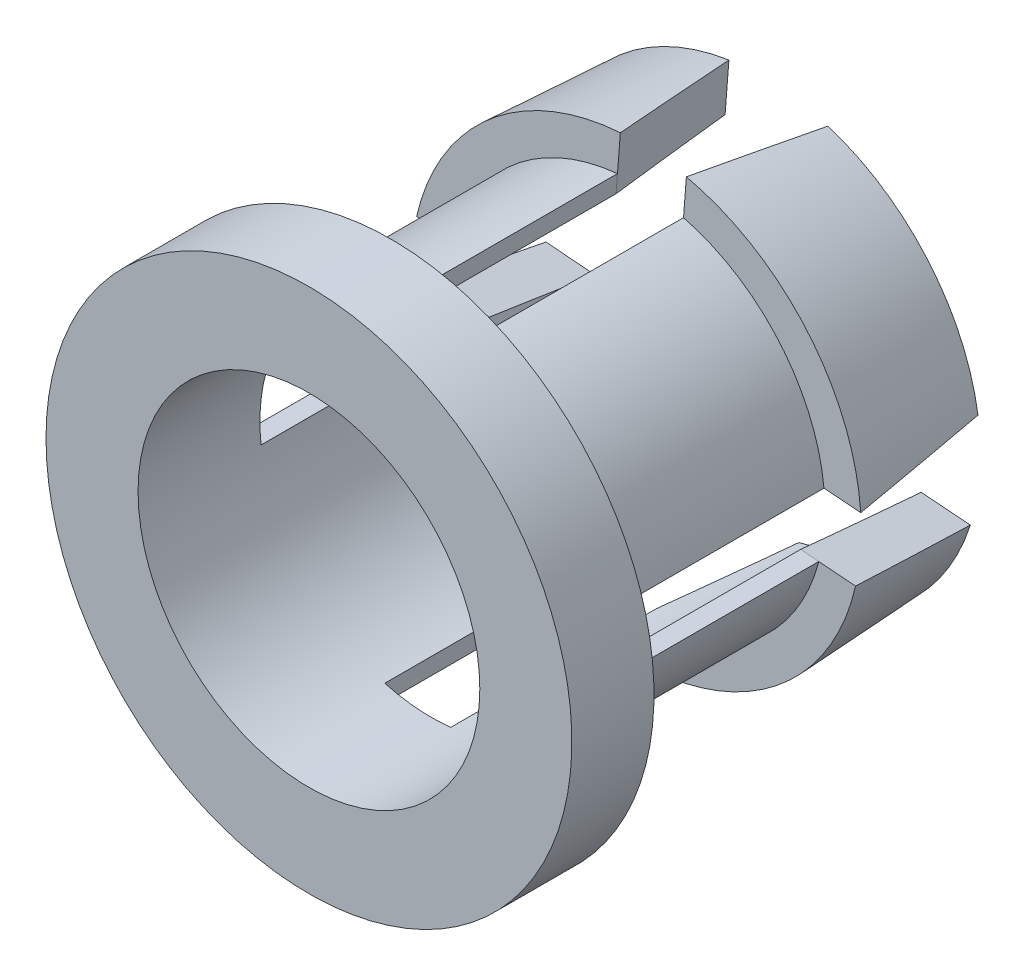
ISO-10303-21;
HEADER;
FILE_DESCRIPTION(('STEP AP214'),'2;1');
FILE_NAME('part.step','',(''),(''),'','','');
FILE_SCHEMA(('AUTOMOTIVE_DESIGN { 1 0 10303 214 1 1 1 1 }'));
ENDSEC;
DATA;
#1=APPLICATION_CONTEXT('core data for automotive mechanical design processes');
#2=APPLICATION_PROTOCOL_DEFINITION('international standard','automotive_design',2000,#1);
#3=PRODUCT_CONTEXT('',#1,'mechanical');
#4=PRODUCT('Part','Part','',(#3));
#5=PRODUCT_RELATED_PRODUCT_CATEGORY('part','',(#4));
#6=PRODUCT_DEFINITION_FORMATION('','',#4);
#7=PRODUCT_DEFINITION_CONTEXT('part definition',#1,'design');
#8=PRODUCT_DEFINITION('design','',#6,#7);
#9=PRODUCT_DEFINITION_SHAPE('','',#8);
#10=(LENGTH_UNIT() NAMED_UNIT(*) SI_UNIT(.MILLI.,.METRE.));
#11=(NAMED_UNIT(*) PLANE_ANGLE_UNIT() SI_UNIT($,.RADIAN.));
#12=(NAMED_UNIT(*) SI_UNIT($,.STERADIAN.) SOLID_ANGLE_UNIT());
#13=UNCERTAINTY_MEASURE_WITH_UNIT(LENGTH_MEASURE(1.E-05),#10,'distance_accuracy_value','');
#14=(GEOMETRIC_REPRESENTATION_CONTEXT(3) GLOBAL_UNCERTAINTY_ASSIGNED_CONTEXT((#13)) GLOBAL_UNIT_ASSIGNED_CONTEXT((#10,
#11,#12)) REPRESENTATION_CONTEXT('',''));
#15=CARTESIAN_POINT('',(0.,0.,0.));
#16=DIRECTION('',(0.,0.,1.));
#17=DIRECTION('',(1.,0.,0.));
#18=AXIS2_PLACEMENT_3D('',#15,#16,#17);
#19=CARTESIAN_POINT('',(4.30503773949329,-0.334326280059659,-4.318));
#20=DIRECTION('',(0.,0.,-1.));
#21=DIRECTION('',(-1.,0.,0.));
#22=AXIS2_PLACEMENT_3D('',#19,#20,#21);
#23=PLANE('',#22);
#24=DIRECTION('',(-0.996998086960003,0.0774261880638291,0.));
#25=VECTOR('',#24,1.);
#26=CARTESIAN_POINT('',(-3.50350037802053,0.908991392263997,-4.318));
#27=LINE('',#26,#25);
#28=CARTESIAN_POINT('',(-3.50350037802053,0.908991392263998,-4.318));
#29=VERTEX_POINT('',#28);
#30=CARTESIAN_POINT('',(-4.20906665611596,0.963785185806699,-4.31800000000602));
#31=VERTEX_POINT('',#30);
#32=EDGE_CURVE('E197',#29,#31,#27,.T.);
#33=ORIENTED_EDGE('',*,*,#32,.F.);
#34=CARTESIAN_POINT('',(0.,0.,-4.318));
#35=DIRECTION('',(0.,0.,-1.));
#36=DIRECTION('',(-1.,0.,0.));
#37=AXIS2_PLACEMENT_3D('',#34,#35,#36);
#38=CIRCLE('',#37,3.6195);
#39=CARTESIAN_POINT('',(-0.35719617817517,3.60183163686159,-4.318));
#40=VERTEX_POINT('',#39);
#41=EDGE_CURVE('E556',#40,#29,#38,.F.);
#42=ORIENTED_EDGE('',*,*,#41,.F.);
#43=DIRECTION('',(-0.077426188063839,-0.996998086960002,0.));
#44=VECTOR('',#43,1.);
#45=CARTESIAN_POINT('',(-0.302402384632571,4.30739791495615,-4.318));
#46=LINE('',#45,#44);
#47=CARTESIAN_POINT('',(-0.302402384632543,4.30739791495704,-4.31800000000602));
#48=VERTEX_POINT('',#47);
#49=EDGE_CURVE('E209',#48,#40,#46,.T.);
#50=ORIENTED_EDGE('',*,*,#49,.F.);
#51=CARTESIAN_POINT('',(0.,0.,-4.31800000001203));
#52=DIRECTION('',(0.,0.,1.));
#53=DIRECTION('',(1.,0.,0.));
#54=AXIS2_PLACEMENT_3D('',#51,#52,#53);
#55=CIRCLE('',#54,4.31800000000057);
#56=EDGE_CURVE('E20',#31,#48,#55,.F.);
#57=ORIENTED_EDGE('',*,*,#56,.F.);
#58=EDGE_LOOP('',(#33,#42,#50,#57));
#59=FACE_BOUND('',#58,.T.);
#60=ADVANCED_FACE('F17',(#59),#23,.F.);
#61=CARTESIAN_POINT('',(4.30503773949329,-0.334326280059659,-4.318));
#62=DIRECTION('',(0.,0.,-1.));
#63=DIRECTION('',(-1.,0.,0.));
#64=AXIS2_PLACEMENT_3D('',#61,#62,#63);
#65=PLANE('',#64);
#66=DIRECTION('',(0.996998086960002,-0.0774261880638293,0.));
#67=VECTOR('',#66,1.);
#68=CARTESIAN_POINT('',(-4.30739791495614,-0.302402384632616,-4.318));
#69=LINE('',#68,#67);
#70=CARTESIAN_POINT('',(-4.30739791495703,-0.302402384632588,-4.31800000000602));
#71=VERTEX_POINT('',#70);
#72=CARTESIAN_POINT('',(-3.60183163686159,-0.357196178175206,-4.318));
#73=VERTEX_POINT('',#72);
#74=EDGE_CURVE('E559',#71,#73,#69,.T.);
#75=ORIENTED_EDGE('',*,*,#74,.F.);
#76=CARTESIAN_POINT('',(0.,0.,-4.31800000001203));
#77=DIRECTION('',(0.,0.,1.));
#78=DIRECTION('',(1.,0.,0.));
#79=AXIS2_PLACEMENT_3D('',#76,#77,#78);
#80=CIRCLE('',#79,4.31800000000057);
#81=CARTESIAN_POINT('',(-0.963785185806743,-4.20906665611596,-4.31800000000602));
#82=VERTEX_POINT('',#81);
#83=EDGE_CURVE('E215',#82,#71,#80,.F.);
#84=ORIENTED_EDGE('',*,*,#83,.F.);
#85=DIRECTION('',(-0.0774261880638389,-0.996998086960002,0.));
#86=VECTOR('',#85,1.);
#87=CARTESIAN_POINT('',(-0.908991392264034,-3.50350037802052,-4.318));
#88=LINE('',#87,#86);
#89=CARTESIAN_POINT('',(-0.908991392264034,-3.50350037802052,-4.318));
#90=VERTEX_POINT('',#89);
#91=EDGE_CURVE('E208',#90,#82,#88,.T.);
#92=ORIENTED_EDGE('',*,*,#91,.F.);
#93=CARTESIAN_POINT('',(0.,0.,-4.318));
#94=DIRECTION('',(0.,0.,-1.));
#95=DIRECTION('',(-1.,0.,0.));
#96=AXIS2_PLACEMENT_3D('',#93,#94,#95);
#97=CIRCLE('',#96,3.6195);
#98=EDGE_CURVE('E554',#73,#90,#97,.F.);
#99=ORIENTED_EDGE('',*,*,#98,.F.);
#100=EDGE_LOOP('',(#75,#84,#92,#99));
#101=FACE_BOUND('',#100,.T.);
#102=ADVANCED_FACE('F256',(#101),#65,.F.);
#103=CARTESIAN_POINT('',(3.60863457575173,-0.280244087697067,0.381));
#104=DIRECTION('',(0.,0.,1.));
#105=DIRECTION('',(1.,0.,0.));
#106=AXIS2_PLACEMENT_3D('',#103,#104,#105);
#107=PLANE('',#106);
#108=CARTESIAN_POINT('',(0.,0.,0.381));
#109=DIRECTION('',(0.,0.,-1.));
#110=DIRECTION('',(-1.,0.,0.));
#111=AXIS2_PLACEMENT_3D('',#108,#109,#110);
#112=CIRCLE('',#111,3.6195);
#113=CARTESIAN_POINT('',(-3.6195,0.,0.381));
#114=VERTEX_POINT('',#113);
#115=EDGE_CURVE('E540',#114,#114,#112,.T.);
#116=ORIENTED_EDGE('',*,*,#115,.F.);
#117=EDGE_LOOP('',(#116));
#118=FACE_BOUND('',#117,.T.);
#119=CARTESIAN_POINT('',(0.,0.,0.381));
#120=DIRECTION('',(0.,0.,-1.));
#121=DIRECTION('',(-1.,0.,0.));
#122=AXIS2_PLACEMENT_3D('',#119,#120,#121);
#123=CIRCLE('',#122,5.0419);
#124=CARTESIAN_POINT('',(-5.0419,0.,0.381));
#125=VERTEX_POINT('',#124);
#126=EDGE_CURVE('E551',#125,#125,#123,.F.);
#127=ORIENTED_EDGE('',*,*,#126,.F.);
#128=EDGE_LOOP('',(#127));
#129=FACE_BOUND('',#128,.T.);
#130=ADVANCED_FACE('F253',(#118,#129),#107,.F.);
#131=CARTESIAN_POINT('',(4.30503773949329,-0.334326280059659,-4.318));
#132=DIRECTION('',(0.,0.,-1.));
#133=DIRECTION('',(-1.,0.,0.));
#134=AXIS2_PLACEMENT_3D('',#131,#132,#133);
#135=PLANE('',#134);
#136=DIRECTION('',(0.996998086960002,-0.077426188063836,0.));
#137=VECTOR('',#136,1.);
#138=CARTESIAN_POINT('',(3.50350037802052,-0.908991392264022,-4.318));
#139=LINE('',#138,#137);
#140=CARTESIAN_POINT('',(3.50350037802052,-0.908991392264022,-4.318));
#141=VERTEX_POINT('',#140);
#142=CARTESIAN_POINT('',(4.20906665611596,-0.963785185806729,-4.31800000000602));
#143=VERTEX_POINT('',#142);
#144=EDGE_CURVE('E633',#141,#143,#139,.T.);
#145=ORIENTED_EDGE('',*,*,#144,.F.);
#146=CARTESIAN_POINT('',(0.,0.,-4.318));
#147=DIRECTION('',(0.,0.,-1.));
#148=DIRECTION('',(-1.,0.,0.));
#149=AXIS2_PLACEMENT_3D('',#146,#147,#148);
#150=CIRCLE('',#149,3.6195);
#151=CARTESIAN_POINT('',(0.357196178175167,-3.60183163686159,-4.318));
#152=VERTEX_POINT('',#151);
#153=EDGE_CURVE('E537',#152,#141,#150,.F.);
#154=ORIENTED_EDGE('',*,*,#153,.F.);
#155=DIRECTION('',(0.0774261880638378,0.996998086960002,0.));
#156=VECTOR('',#155,1.);
#157=CARTESIAN_POINT('',(0.302402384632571,-4.30739791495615,-4.318));
#158=LINE('',#157,#156);
#159=CARTESIAN_POINT('',(0.302402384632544,-4.30739791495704,-4.31800000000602));
#160=VERTEX_POINT('',#159);
#161=EDGE_CURVE('E562',#160,#152,#158,.T.);
#162=ORIENTED_EDGE('',*,*,#161,.F.);
#163=CARTESIAN_POINT('',(0.,0.,-4.31800000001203));
#164=DIRECTION('',(0.,0.,1.));
#165=DIRECTION('',(1.,0.,0.));
#166=AXIS2_PLACEMENT_3D('',#163,#164,#165);
#167=CIRCLE('',#166,4.31800000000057);
#168=EDGE_CURVE('E548',#143,#160,#167,.F.);
#169=ORIENTED_EDGE('',*,*,#168,.F.);
#170=EDGE_LOOP('',(#145,#154,#162,#169));
#171=FACE_BOUND('',#170,.T.);
#172=ADVANCED_FACE('F249',(#171),#135,.F.);
#173=CARTESIAN_POINT('',(4.30503773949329,-0.334326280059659,-4.318));
#174=DIRECTION('',(0.,0.,-1.));
#175=DIRECTION('',(-1.,0.,0.));
#176=AXIS2_PLACEMENT_3D('',#173,#174,#175);
#177=PLANE('',#176);
#178=DIRECTION('',(-0.996998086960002,0.0774261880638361,0.));
#179=VECTOR('',#178,1.);
#180=CARTESIAN_POINT('',(4.30739791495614,0.302402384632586,-4.318));
#181=LINE('',#180,#179);
#182=CARTESIAN_POINT('',(4.30739791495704,0.302402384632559,-4.31800000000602));
#183=VERTEX_POINT('',#182);
#184=CARTESIAN_POINT('',(3.60183163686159,0.357196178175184,-4.318));
#185=VERTEX_POINT('',#184);
#186=EDGE_CURVE('E216',#183,#185,#181,.T.);
#187=ORIENTED_EDGE('',*,*,#186,.F.);
#188=CARTESIAN_POINT('',(0.,0.,-4.31800000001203));
#189=DIRECTION('',(0.,0.,1.));
#190=DIRECTION('',(1.,0.,0.));
#191=AXIS2_PLACEMENT_3D('',#188,#189,#190);
#192=CIRCLE('',#191,4.31800000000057);
#193=CARTESIAN_POINT('',(0.963785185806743,4.20906665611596,-4.31800000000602));
#194=VERTEX_POINT('',#193);
#195=EDGE_CURVE('E545',#194,#183,#192,.F.);
#196=ORIENTED_EDGE('',*,*,#195,.F.);
#197=DIRECTION('',(0.0774261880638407,0.996998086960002,0.));
#198=VECTOR('',#197,1.);
#199=CARTESIAN_POINT('',(0.908991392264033,3.50350037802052,-4.318));
#200=LINE('',#199,#198);
#201=CARTESIAN_POINT('',(0.908991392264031,3.50350037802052,-4.318));
#202=VERTEX_POINT('',#201);
#203=EDGE_CURVE('E635',#202,#194,#200,.T.);
#204=ORIENTED_EDGE('',*,*,#203,.F.);
#205=CARTESIAN_POINT('',(0.,0.,-4.318));
#206=DIRECTION('',(0.,0.,-1.));
#207=DIRECTION('',(-1.,0.,0.));
#208=AXIS2_PLACEMENT_3D('',#205,#206,#207);
#209=CIRCLE('',#208,3.6195);
#210=EDGE_CURVE('E479',#185,#202,#209,.F.);
#211=ORIENTED_EDGE('',*,*,#210,.F.);
#212=EDGE_LOOP('',(#187,#196,#204,#211));
#213=FACE_BOUND('',#212,.T.);
#214=ADVANCED_FACE('F243',(#213),#177,.F.);
#215=CARTESIAN_POINT('',(0.,0.,-4.31800000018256));
#216=DIRECTION('',(0.,0.,1.));
#217=DIRECTION('',(1.,0.,0.));
#218=AXIS2_PLACEMENT_3D('',#215,#216,#217);
#219=CONICAL_SURFACE('',#218,4.3179999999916,0.0525830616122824);
#220=ORIENTED_EDGE('',*,*,#56,.T.);
#221=CARTESIAN_POINT('',(-0.633639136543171,4.14282300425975,-6.7309999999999));
#222=CARTESIAN_POINT('',(-0.620207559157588,4.15006909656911,-6.63349030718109));
#223=CARTESIAN_POINT('',(-0.606781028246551,4.15723999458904,-6.5359743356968));
#224=CARTESIAN_POINT('',(-0.579820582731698,4.17149595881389,-6.34007799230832));
#225=CARTESIAN_POINT('',(-0.566286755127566,4.17857972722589,-6.24169751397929));
#226=CARTESIAN_POINT('',(-0.539111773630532,4.19266015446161,-6.04407215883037));
#227=CARTESIAN_POINT('',(-0.525470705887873,4.19965552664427,-5.9448271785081));
#228=CARTESIAN_POINT('',(-0.498081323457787,4.21355784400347,-5.74547281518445));
#229=CARTESIAN_POINT('',(-0.484333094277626,4.22046351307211,-5.64536333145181));
#230=CARTESIAN_POINT('',(-0.456729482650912,4.23418510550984,-5.44427995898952));
#231=CARTESIAN_POINT('',(-0.442874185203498,4.24099976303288,-5.3433059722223));
#232=CARTESIAN_POINT('',(-0.41505654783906,4.25453800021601,-5.14049359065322));
#233=CARTESIAN_POINT('',(-0.401094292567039,4.26126032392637,-5.0386551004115));
#234=CARTESIAN_POINT('',(-0.373062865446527,4.27461255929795,-4.83411371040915));
#235=CARTESIAN_POINT('',(-0.358993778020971,4.28124122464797,-4.73141071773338));
#236=CARTESIAN_POINT('',(-0.330748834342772,4.29440477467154,-4.52514031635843));
#237=CARTESIAN_POINT('',(-0.316573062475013,4.30093842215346,-4.42157281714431));
#238=CARTESIAN_POINT('',(-0.302402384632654,4.30739791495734,-4.31800000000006));
#239=B_SPLINE_CURVE_WITH_KNOTS('',3,(#221,#222,#223,#224,#225,#226,#227,#228,#229,#230,#231,
#232,#233,#234,#235,#236,#237,#238),.UNSPECIFIED.,.F.,.F.,(4,2,2,2,2,2,2,2,4),(0.,
0.296090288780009,0.594768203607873,0.896034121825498,1.19988841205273,1.50633143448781,
1.81536354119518,2.12698507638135,2.44119637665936),.UNSPECIFIED.);
#240=CARTESIAN_POINT('',(-0.633639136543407,4.14282300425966,-6.73100000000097));
#241=VERTEX_POINT('',#240);
#242=EDGE_CURVE('E230',#48,#241,#239,.F.);
#243=ORIENTED_EDGE('',*,*,#242,.T.);
#244=CARTESIAN_POINT('',(0.,0.,-6.73100000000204));
#245=DIRECTION('',(0.,0.,1.));
#246=DIRECTION('',(1.,0.,0.));
#247=AXIS2_PLACEMENT_3D('',#244,#245,#246);
#248=CIRCLE('',#247,4.19099999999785);
#249=CARTESIAN_POINT('',(-3.99532611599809,1.2656422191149,-6.73100000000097));
#250=VERTEX_POINT('',#249);
#251=EDGE_CURVE('E219',#241,#250,#248,.T.);
#252=ORIENTED_EDGE('',*,*,#251,.T.);
#253=CARTESIAN_POINT('',(-4.20906665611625,0.963785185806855,-4.31800000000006));
#254=CARTESIAN_POINT('',(-4.20049683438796,0.976788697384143,-4.4215728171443));
#255=CARTESIAN_POINT('',(-4.19185296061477,0.989785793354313,-4.5251403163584));
#256=CARTESIAN_POINT('',(-4.1744865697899,1.01565980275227,-4.73141071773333));
#257=CARTESIAN_POINT('',(-4.16576528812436,1.02853682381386,-4.83411371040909));
#258=CARTESIAN_POINT('',(-4.14824543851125,1.05417074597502,-5.03865510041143));
#259=CARTESIAN_POINT('',(-4.13944811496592,1.06692775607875,-5.14049359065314));
#260=CARTESIAN_POINT('',(-4.12177750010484,1.09232173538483,-5.34330597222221));
#261=CARTESIAN_POINT('',(-4.11290546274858,1.10495881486,-5.44427995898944));
#262=CARTESIAN_POINT('',(-4.09508673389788,1.13011302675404,-5.64536333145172));
#263=CARTESIAN_POINT('',(-4.08614130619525,1.14263027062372,-5.74547281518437));
#264=CARTESIAN_POINT('',(-4.06817709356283,1.16754492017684,-5.94482717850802));
#265=CARTESIAN_POINT('',(-4.05915958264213,1.17994243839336,-6.04407215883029));
#266=CARTESIAN_POINT('',(-4.04105249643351,1.2046177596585,-6.24169751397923));
#267=CARTESIAN_POINT('',(-4.03196420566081,1.21689567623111,-6.34007799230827));
#268=CARTESIAN_POINT('',(-4.01371680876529,1.24133193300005,-6.53597433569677));
#269=CARTESIAN_POINT('',(-4.004558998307,1.2534903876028,-6.63349030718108));
#270=CARTESIAN_POINT('',(-3.99532611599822,1.26564221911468,-6.73099999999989));
#271=B_SPLINE_CURVE_WITH_KNOTS('',3,(#253,#254,#255,#256,#257,#258,#259,#260,#261,#262,#263,
#264,#265,#266,#267,#268,#269,#270),.UNSPECIFIED.,.F.,.F.,(4,2,2,2,2,2,2,2,4),(0.,
0.314211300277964,0.625832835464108,0.93486494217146,1.24130796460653,1.54516225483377,
1.84642817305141,2.1451060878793,2.44119637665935),.UNSPECIFIED.);
#272=EDGE_CURVE('E201',#250,#31,#271,.F.);
#273=ORIENTED_EDGE('',*,*,#272,.T.);
#274=EDGE_LOOP('',(#220,#243,#252,#273));
#275=FACE_BOUND('',#274,.T.);
#276=ADVANCED_FACE('F217',(#275),#219,.T.);
#277=CARTESIAN_POINT('',(0.,0.,-4.31800000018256));
#278=DIRECTION('',(0.,0.,1.));
#279=DIRECTION('',(1.,0.,0.));
#280=AXIS2_PLACEMENT_3D('',#277,#278,#279);
#281=CONICAL_SURFACE('',#280,4.3179999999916,0.0525830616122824);
#282=CARTESIAN_POINT('',(0.,0.,-6.73100000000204));
#283=DIRECTION('',(0.,0.,1.));
#284=DIRECTION('',(1.,0.,0.));
#285=AXIS2_PLACEMENT_3D('',#282,#283,#284);
#286=CIRCLE('',#285,4.19099999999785);
#287=CARTESIAN_POINT('',(-4.14282300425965,-0.633639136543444,-6.73100000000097));
#288=VERTEX_POINT('',#287);
#289=CARTESIAN_POINT('',(-1.26564221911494,-3.99532611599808,-6.73100000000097));
#290=VERTEX_POINT('',#289);
#291=EDGE_CURVE('E524',#288,#290,#286,.T.);
#292=ORIENTED_EDGE('',*,*,#291,.T.);
#293=CARTESIAN_POINT('',(-0.963785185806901,-4.20906665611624,-4.31800000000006));
#294=CARTESIAN_POINT('',(-0.976788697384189,-4.20049683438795,-4.42157281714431));
#295=CARTESIAN_POINT('',(-0.989785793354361,-4.19185296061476,-4.52514031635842));
#296=CARTESIAN_POINT('',(-1.01565980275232,-4.17448656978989,-4.73141071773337));
#297=CARTESIAN_POINT('',(-1.02853682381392,-4.16576528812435,-4.83411371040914));
#298=CARTESIAN_POINT('',(-1.05417074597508,-4.14824543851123,-5.03865510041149));
#299=CARTESIAN_POINT('',(-1.06692775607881,-4.1394481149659,-5.14049359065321));
#300=CARTESIAN_POINT('',(-1.09232173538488,-4.12177750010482,-5.34330597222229));
#301=CARTESIAN_POINT('',(-1.10495881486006,-4.11290546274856,-5.44427995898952));
#302=CARTESIAN_POINT('',(-1.1301130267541,-4.09508673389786,-5.6453633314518));
#303=CARTESIAN_POINT('',(-1.14263027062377,-4.08614130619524,-5.74547281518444));
#304=CARTESIAN_POINT('',(-1.16754492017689,-4.06817709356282,-5.94482717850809));
#305=CARTESIAN_POINT('',(-1.17994243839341,-4.05915958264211,-6.04407215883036));
#306=CARTESIAN_POINT('',(-1.20461775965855,-4.04105249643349,-6.24169751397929));
#307=CARTESIAN_POINT('',(-1.21689567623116,-4.03196420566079,-6.34007799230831));
#308=CARTESIAN_POINT('',(-1.24133193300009,-4.01371680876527,-6.53597433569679));
#309=CARTESIAN_POINT('',(-1.25349038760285,-4.00455899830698,-6.63349030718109));
#310=CARTESIAN_POINT('',(-1.26564221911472,-3.99532611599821,-6.7309999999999));
#311=B_SPLINE_CURVE_WITH_KNOTS('',3,(#293,#294,#295,#296,#297,#298,#299,#300,#301,#302,#303,
#304,#305,#306,#307,#308,#309,#310),.UNSPECIFIED.,.F.,.F.,(4,2,2,2,2,2,2,2,4),(0.,
0.314211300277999,0.625832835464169,0.934864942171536,1.24130796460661,1.54516225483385,
1.84642817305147,2.14510608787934,2.44119637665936),.UNSPECIFIED.);
#312=EDGE_CURVE('E433',#290,#82,#311,.F.);
#313=ORIENTED_EDGE('',*,*,#312,.T.);
#314=ORIENTED_EDGE('',*,*,#83,.T.);
#315=CARTESIAN_POINT('',(-4.14282300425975,-0.633639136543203,-6.73099999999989));
#316=CARTESIAN_POINT('',(-4.1500690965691,-0.620207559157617,-6.63349030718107));
#317=CARTESIAN_POINT('',(-4.15723999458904,-0.606781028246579,-6.53597433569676));
#318=CARTESIAN_POINT('',(-4.17149595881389,-0.579820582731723,-6.34007799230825));
#319=CARTESIAN_POINT('',(-4.17857972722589,-0.56628675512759,-6.24169751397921));
#320=CARTESIAN_POINT('',(-4.19266015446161,-0.539111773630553,-6.04407215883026));
#321=CARTESIAN_POINT('',(-4.19965552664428,-0.525470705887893,-5.94482717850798));
#322=CARTESIAN_POINT('',(-4.21355784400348,-0.498081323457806,-5.74547281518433));
#323=CARTESIAN_POINT('',(-4.22046351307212,-0.484333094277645,-5.64536333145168));
#324=CARTESIAN_POINT('',(-4.23418510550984,-0.456729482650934,-5.4442799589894));
#325=CARTESIAN_POINT('',(-4.24099976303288,-0.442874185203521,-5.34330597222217));
#326=CARTESIAN_POINT('',(-4.25453800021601,-0.415056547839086,-5.1404935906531));
#327=CARTESIAN_POINT('',(-4.26126032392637,-0.401094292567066,-5.03865510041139));
#328=CARTESIAN_POINT('',(-4.27461255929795,-0.373062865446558,-4.83411371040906));
#329=CARTESIAN_POINT('',(-4.28124122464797,-0.358993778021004,-4.73141071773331));
#330=CARTESIAN_POINT('',(-4.29440477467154,-0.33074883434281,-4.52514031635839));
#331=CARTESIAN_POINT('',(-4.30093842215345,-0.316573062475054,-4.42157281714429));
#332=CARTESIAN_POINT('',(-4.30739791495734,-0.302402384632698,-4.31800000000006));
#333=B_SPLINE_CURVE_WITH_KNOTS('',3,(#315,#316,#317,#318,#319,#320,#321,#322,#323,#324,#325,
#326,#327,#328,#329,#330,#331,#332),.UNSPECIFIED.,.F.,.F.,(4,2,2,2,2,2,2,2,4),(0.,
0.296090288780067,0.594768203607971,0.896034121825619,1.19988841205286,1.50633143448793,
1.81536354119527,2.12698507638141,2.44119637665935),.UNSPECIFIED.);
#334=EDGE_CURVE('E438',#71,#288,#333,.F.);
#335=ORIENTED_EDGE('',*,*,#334,.T.);
#336=EDGE_LOOP('',(#292,#313,#314,#335));
#337=FACE_BOUND('',#336,.T.);
#338=ADVANCED_FACE('F242',(#337),#281,.T.);
#339=CARTESIAN_POINT('',(0.,0.,1.9558));
#340=DIRECTION('',(0.,0.,-1.));
#341=DIRECTION('',(-1.,0.,0.));
#342=AXIS2_PLACEMENT_3D('',#339,#340,#341);
#343=CYLINDRICAL_SURFACE('',#342,5.0419);
#344=CARTESIAN_POINT('',(0.,0.,1.9558));
#345=DIRECTION('',(0.,0.,-1.));
#346=DIRECTION('',(-1.,0.,0.));
#347=AXIS2_PLACEMENT_3D('',#344,#345,#346);
#348=CIRCLE('',#347,5.0419);
#349=CARTESIAN_POINT('',(-5.0419,0.,1.9558));
#350=VERTEX_POINT('',#349);
#351=EDGE_CURVE('E431',#350,#350,#348,.T.);
#352=ORIENTED_EDGE('',*,*,#351,.T.);
#353=EDGE_LOOP('',(#352));
#354=FACE_BOUND('',#353,.T.);
#355=ORIENTED_EDGE('',*,*,#126,.T.);
#356=EDGE_LOOP('',(#355));
#357=FACE_BOUND('',#356,.T.);
#358=ADVANCED_FACE('F684',(#354,#357),#343,.T.);
#359=CARTESIAN_POINT('',(0.,0.,-4.31800000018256));
#360=DIRECTION('',(0.,0.,1.));
#361=DIRECTION('',(1.,0.,0.));
#362=AXIS2_PLACEMENT_3D('',#359,#360,#361);
#363=CONICAL_SURFACE('',#362,4.3179999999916,0.0525830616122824);
#364=ORIENTED_EDGE('',*,*,#168,.T.);
#365=CARTESIAN_POINT('',(0.633639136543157,-4.14282300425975,-6.73099999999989));
#366=CARTESIAN_POINT('',(0.620207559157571,-4.15006909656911,-6.63349030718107));
#367=CARTESIAN_POINT('',(0.606781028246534,-4.15723999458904,-6.53597433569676));
#368=CARTESIAN_POINT('',(0.579820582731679,-4.1714959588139,-6.34007799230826));
#369=CARTESIAN_POINT('',(0.566286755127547,-4.1785797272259,-6.24169751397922));
#370=CARTESIAN_POINT('',(0.53911177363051,-4.19266015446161,-6.04407215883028));
#371=CARTESIAN_POINT('',(0.525470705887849,-4.19965552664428,-5.94482717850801));
#372=CARTESIAN_POINT('',(0.498081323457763,-4.21355784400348,-5.74547281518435));
#373=CARTESIAN_POINT('',(0.484333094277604,-4.22046351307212,-5.6453633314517));
#374=CARTESIAN_POINT('',(0.456729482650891,-4.23418510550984,-5.44427995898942));
#375=CARTESIAN_POINT('',(0.442874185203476,-4.24099976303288,-5.3433059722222));
#376=CARTESIAN_POINT('',(0.41505654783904,-4.25453800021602,-5.14049359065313));
#377=CARTESIAN_POINT('',(0.401094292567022,-4.26126032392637,-5.03865510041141));
#378=CARTESIAN_POINT('',(0.373062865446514,-4.27461255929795,-4.83411371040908));
#379=CARTESIAN_POINT('',(0.358993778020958,-4.28124122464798,-4.73141071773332));
#380=CARTESIAN_POINT('',(0.33074883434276,-4.29440477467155,-4.5251403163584));
#381=CARTESIAN_POINT('',(0.316573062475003,-4.30093842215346,-4.4215728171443));
#382=CARTESIAN_POINT('',(0.302402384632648,-4.30739791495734,-4.31800000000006));
#383=B_SPLINE_CURVE_WITH_KNOTS('',3,(#365,#366,#367,#368,#369,#370,#371,#372,#373,#374,#375,
#376,#377,#378,#379,#380,#381,#382),.UNSPECIFIED.,.F.,.F.,(4,2,2,2,2,2,2,2,4),(0.,
0.296090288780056,0.594768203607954,0.896034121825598,1.19988841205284,1.50633143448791,
1.81536354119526,2.1269850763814,2.44119637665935),.UNSPECIFIED.);
#384=CARTESIAN_POINT('',(0.633639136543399,-4.14282300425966,-6.73100000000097));
#385=VERTEX_POINT('',#384);
#386=EDGE_CURVE('E409',#160,#385,#383,.F.);
#387=ORIENTED_EDGE('',*,*,#386,.T.);
#388=CARTESIAN_POINT('',(0.,0.,-6.73100000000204));
#389=DIRECTION('',(0.,0.,1.));
#390=DIRECTION('',(1.,0.,0.));
#391=AXIS2_PLACEMENT_3D('',#388,#389,#390);
#392=CIRCLE('',#391,4.19099999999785);
#393=CARTESIAN_POINT('',(3.99532611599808,-1.26564221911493,-6.73100000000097));
#394=VERTEX_POINT('',#393);
#395=EDGE_CURVE('E510',#385,#394,#392,.T.);
#396=ORIENTED_EDGE('',*,*,#395,.T.);
#397=CARTESIAN_POINT('',(4.20906665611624,-0.963785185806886,-4.31800000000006));
#398=CARTESIAN_POINT('',(4.20049683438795,-0.97678869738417,-4.4215728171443));
#399=CARTESIAN_POINT('',(4.19185296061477,-0.98978579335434,-4.52514031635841));
#400=CARTESIAN_POINT('',(4.1744865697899,-1.0156598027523,-4.73141071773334));
#401=CARTESIAN_POINT('',(4.16576528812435,-1.02853682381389,-4.8341137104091));
#402=CARTESIAN_POINT('',(4.14824543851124,-1.05417074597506,-5.03865510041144));
#403=CARTESIAN_POINT('',(4.13944811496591,-1.06692775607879,-5.14049359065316));
#404=CARTESIAN_POINT('',(4.12177750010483,-1.09232173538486,-5.34330597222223));
#405=CARTESIAN_POINT('',(4.11290546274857,-1.10495881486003,-5.44427995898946));
#406=CARTESIAN_POINT('',(4.09508673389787,-1.13011302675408,-5.64536333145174));
#407=CARTESIAN_POINT('',(4.08614130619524,-1.14263027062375,-5.74547281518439));
#408=CARTESIAN_POINT('',(4.06817709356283,-1.16754492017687,-5.94482717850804));
#409=CARTESIAN_POINT('',(4.05915958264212,-1.17994243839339,-6.04407215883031));
#410=CARTESIAN_POINT('',(4.0410524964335,-1.20461775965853,-6.24169751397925));
#411=CARTESIAN_POINT('',(4.0319642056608,-1.21689567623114,-6.34007799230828));
#412=CARTESIAN_POINT('',(4.01371680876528,-1.24133193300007,-6.53597433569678));
#413=CARTESIAN_POINT('',(4.00455899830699,-1.25349038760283,-6.63349030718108));
#414=CARTESIAN_POINT('',(3.99532611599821,-1.26564221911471,-6.7309999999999));
#415=B_SPLINE_CURVE_WITH_KNOTS('',3,(#397,#398,#399,#400,#401,#402,#403,#404,#405,#406,#407,
#408,#409,#410,#411,#412,#413,#414),.UNSPECIFIED.,.F.,.F.,(4,2,2,2,2,2,2,2,4),(0.,
0.314211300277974,0.625832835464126,0.934864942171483,1.24130796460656,1.5451622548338,
1.84642817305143,2.14510608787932,2.44119637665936),.UNSPECIFIED.);
#416=EDGE_CURVE('E404',#394,#143,#415,.F.);
#417=ORIENTED_EDGE('',*,*,#416,.T.);
#418=EDGE_LOOP('',(#364,#387,#396,#417));
#419=FACE_BOUND('',#418,.T.);
#420=ADVANCED_FACE('F377',(#419),#363,.T.);
#421=CARTESIAN_POINT('',(0.,0.,-4.31800000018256));
#422=DIRECTION('',(0.,0.,1.));
#423=DIRECTION('',(1.,0.,0.));
#424=AXIS2_PLACEMENT_3D('',#421,#422,#423);
#425=CONICAL_SURFACE('',#424,4.3179999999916,0.0525830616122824);
#426=CARTESIAN_POINT('',(0.,0.,-6.73100000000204));
#427=DIRECTION('',(0.,0.,1.));
#428=DIRECTION('',(1.,0.,0.));
#429=AXIS2_PLACEMENT_3D('',#426,#427,#428);
#430=CIRCLE('',#429,4.19099999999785);
#431=CARTESIAN_POINT('',(4.14282300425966,0.633639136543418,-6.73100000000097));
#432=VERTEX_POINT('',#431);
#433=CARTESIAN_POINT('',(1.26564221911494,3.99532611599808,-6.73100000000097));
#434=VERTEX_POINT('',#433);
#435=EDGE_CURVE('E496',#432,#434,#430,.T.);
#436=ORIENTED_EDGE('',*,*,#435,.T.);
#437=CARTESIAN_POINT('',(0.963785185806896,4.20906665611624,-4.31800000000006));
#438=CARTESIAN_POINT('',(0.976788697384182,4.20049683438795,-4.42157281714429));
#439=CARTESIAN_POINT('',(0.989785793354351,4.19185296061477,-4.52514031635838));
#440=CARTESIAN_POINT('',(1.0156598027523,4.1744865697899,-4.73141071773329));
#441=CARTESIAN_POINT('',(1.0285368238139,4.16576528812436,-4.83411371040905));
#442=CARTESIAN_POINT('',(1.05417074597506,4.14824543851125,-5.03865510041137));
#443=CARTESIAN_POINT('',(1.06692775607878,4.13944811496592,-5.14049359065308));
#444=CARTESIAN_POINT('',(1.09232173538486,4.12177750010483,-5.34330597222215));
#445=CARTESIAN_POINT('',(1.10495881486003,4.11290546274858,-5.44427995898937));
#446=CARTESIAN_POINT('',(1.13011302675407,4.09508673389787,-5.64536333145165));
#447=CARTESIAN_POINT('',(1.14263027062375,4.08614130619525,-5.7454728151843));
#448=CARTESIAN_POINT('',(1.16754492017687,4.06817709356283,-5.94482717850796));
#449=CARTESIAN_POINT('',(1.17994243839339,4.05915958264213,-6.04407215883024));
#450=CARTESIAN_POINT('',(1.20461775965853,4.0410524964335,-6.24169751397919));
#451=CARTESIAN_POINT('',(1.21689567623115,4.0319642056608,-6.34007799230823));
#452=CARTESIAN_POINT('',(1.24133193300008,4.01371680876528,-6.53597433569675));
#453=CARTESIAN_POINT('',(1.25349038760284,4.00455899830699,-6.63349030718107));
#454=CARTESIAN_POINT('',(1.26564221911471,3.99532611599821,-6.73099999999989));
#455=B_SPLINE_CURVE_WITH_KNOTS('',3,(#437,#438,#439,#440,#441,#442,#443,#444,#445,#446,#447,
#448,#449,#450,#451,#452,#453,#454),.UNSPECIFIED.,.F.,.F.,(4,2,2,2,2,2,2,2,4),(0.,
0.314211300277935,0.625832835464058,0.934864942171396,1.24130796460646,1.54516225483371,
1.84642817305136,2.14510608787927,2.44119637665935),.UNSPECIFIED.);
#456=EDGE_CURVE('E382',#434,#194,#455,.F.);
#457=ORIENTED_EDGE('',*,*,#456,.T.);
#458=ORIENTED_EDGE('',*,*,#195,.T.);
#459=CARTESIAN_POINT('',(4.14282300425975,0.633639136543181,-6.73099999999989));
#460=CARTESIAN_POINT('',(4.15006909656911,0.620207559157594,-6.63349030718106));
#461=CARTESIAN_POINT('',(4.15723999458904,0.606781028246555,-6.53597433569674));
#462=CARTESIAN_POINT('',(4.1714959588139,0.579820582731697,-6.34007799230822));
#463=CARTESIAN_POINT('',(4.1785797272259,0.566286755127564,-6.24169751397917));
#464=CARTESIAN_POINT('',(4.19266015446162,0.539111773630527,-6.04407215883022));
#465=CARTESIAN_POINT('',(4.19965552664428,0.525470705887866,-5.94482717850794));
#466=CARTESIAN_POINT('',(4.21355784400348,0.498081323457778,-5.74547281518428));
#467=CARTESIAN_POINT('',(4.22046351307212,0.484333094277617,-5.64536333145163));
#468=CARTESIAN_POINT('',(4.23418510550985,0.456729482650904,-5.44427995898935));
#469=CARTESIAN_POINT('',(4.24099976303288,0.44287418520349,-5.34330597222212));
#470=CARTESIAN_POINT('',(4.25453800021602,0.415056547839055,-5.14049359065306));
#471=CARTESIAN_POINT('',(4.26126032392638,0.401094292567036,-5.03865510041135));
#472=CARTESIAN_POINT('',(4.27461255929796,0.37306286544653,-4.83411371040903));
#473=CARTESIAN_POINT('',(4.28124122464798,0.358993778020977,-4.73141071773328));
#474=CARTESIAN_POINT('',(4.29440477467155,0.330748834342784,-4.52514031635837));
#475=CARTESIAN_POINT('',(4.30093842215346,0.316573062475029,-4.42157281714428));
#476=CARTESIAN_POINT('',(4.30739791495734,0.302402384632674,-4.31800000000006));
#477=B_SPLINE_CURVE_WITH_KNOTS('',3,(#459,#460,#461,#462,#463,#464,#465,#466,#467,#468,#469,
#470,#471,#472,#473,#474,#475,#476),.UNSPECIFIED.,.F.,.F.,(4,2,2,2,2,2,2,2,4),(0.,
0.29609028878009,0.594768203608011,0.896034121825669,1.19988841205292,1.50633143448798,
1.81536354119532,2.12698507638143,2.44119637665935),.UNSPECIFIED.);
#478=EDGE_CURVE('E386',#183,#432,#477,.F.);
#479=ORIENTED_EDGE('',*,*,#478,.T.);
#480=EDGE_LOOP('',(#436,#457,#458,#479));
#481=FACE_BOUND('',#480,.T.);
#482=ADVANCED_FACE('F372',(#481),#425,.T.);
#483=CARTESIAN_POINT('',(0.,0.,1.9558));
#484=DIRECTION('',(0.,0.,-1.));
#485=DIRECTION('',(-1.,0.,0.));
#486=AXIS2_PLACEMENT_3D('',#483,#484,#485);
#487=CYLINDRICAL_SURFACE('',#486,3.6195);
#488=ORIENTED_EDGE('',*,*,#115,.T.);
#489=EDGE_LOOP('',(#488));
#490=FACE_BOUND('',#489,.T.);
#491=ORIENTED_EDGE('',*,*,#210,.T.);
#492=DIRECTION('',(0.,0.,1.));
#493=VECTOR('',#492,1.);
#494=CARTESIAN_POINT('',(0.908991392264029,3.50350037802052,-4.318));
#495=LINE('',#494,#493);
#496=CARTESIAN_POINT('',(0.908991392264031,3.50350037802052,-0.381));
#497=VERTEX_POINT('',#496);
#498=EDGE_CURVE('E480',#202,#497,#495,.T.);
#499=ORIENTED_EDGE('',*,*,#498,.T.);
#500=CARTESIAN_POINT('',(0.,0.,-0.381));
#501=DIRECTION('',(0.,0.,-1.));
#502=DIRECTION('',(-1.,0.,0.));
#503=AXIS2_PLACEMENT_3D('',#500,#501,#502);
#504=CIRCLE('',#503,3.6195);
#505=CARTESIAN_POINT('',(-0.35719617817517,3.60183163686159,-0.381));
#506=VERTEX_POINT('',#505);
#507=EDGE_CURVE('E543',#497,#506,#504,.F.);
#508=ORIENTED_EDGE('',*,*,#507,.T.);
#509=DIRECTION('',(0.,0.,1.));
#510=VECTOR('',#509,1.);
#511=CARTESIAN_POINT('',(-0.35719617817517,3.60183163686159,-0.380999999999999));
#512=LINE('',#511,#510);
#513=EDGE_CURVE('E477',#506,#40,#512,.F.);
#514=ORIENTED_EDGE('',*,*,#513,.T.);
#515=ORIENTED_EDGE('',*,*,#41,.T.);
#516=DIRECTION('',(0.,0.,1.));
#517=VECTOR('',#516,1.);
#518=CARTESIAN_POINT('',(-3.50350037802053,0.908991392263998,-0.380999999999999));
#519=LINE('',#518,#517);
#520=CARTESIAN_POINT('',(-3.50350037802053,0.908991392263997,-0.380999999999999));
#521=VERTEX_POINT('',#520);
#522=EDGE_CURVE('E222',#29,#521,#519,.T.);
#523=ORIENTED_EDGE('',*,*,#522,.T.);
#524=CARTESIAN_POINT('',(0.,0.,-0.380999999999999));
#525=DIRECTION('',(0.,0.,-1.));
#526=DIRECTION('',(-1.,0.,0.));
#527=AXIS2_PLACEMENT_3D('',#524,#525,#526);
#528=CIRCLE('',#527,3.6195);
#529=CARTESIAN_POINT('',(-3.60183163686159,-0.357196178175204,-0.381));
#530=VERTEX_POINT('',#529);
#531=EDGE_CURVE('E461',#521,#530,#528,.F.);
#532=ORIENTED_EDGE('',*,*,#531,.T.);
#533=DIRECTION('',(0.,0.,1.));
#534=VECTOR('',#533,1.);
#535=CARTESIAN_POINT('',(-3.60183163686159,-0.357196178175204,-4.318));
#536=LINE('',#535,#534);
#537=EDGE_CURVE('E447',#530,#73,#536,.F.);
#538=ORIENTED_EDGE('',*,*,#537,.T.);
#539=ORIENTED_EDGE('',*,*,#98,.T.);
#540=DIRECTION('',(0.,0.,1.));
#541=VECTOR('',#540,1.);
#542=CARTESIAN_POINT('',(-0.908991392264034,-3.50350037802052,-0.380999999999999));
#543=LINE('',#542,#541);
#544=CARTESIAN_POINT('',(-0.908991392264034,-3.50350037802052,-0.381));
#545=VERTEX_POINT('',#544);
#546=EDGE_CURVE('E428',#90,#545,#543,.T.);
#547=ORIENTED_EDGE('',*,*,#546,.T.);
#548=CARTESIAN_POINT('',(0.,0.,-0.381));
#549=DIRECTION('',(0.,0.,-1.));
#550=DIRECTION('',(-1.,0.,0.));
#551=AXIS2_PLACEMENT_3D('',#548,#549,#550);
#552=CIRCLE('',#551,3.6195);
#553=CARTESIAN_POINT('',(0.357196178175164,-3.60183163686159,-0.380999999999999));
#554=VERTEX_POINT('',#553);
#555=EDGE_CURVE('E517',#545,#554,#552,.F.);
#556=ORIENTED_EDGE('',*,*,#555,.T.);
#557=DIRECTION('',(0.,0.,1.));
#558=VECTOR('',#557,1.);
#559=CARTESIAN_POINT('',(0.357196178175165,-3.60183163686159,-4.318));
#560=LINE('',#559,#558);
#561=EDGE_CURVE('E419',#554,#152,#560,.F.);
#562=ORIENTED_EDGE('',*,*,#561,.T.);
#563=ORIENTED_EDGE('',*,*,#153,.T.);
#564=DIRECTION('',(0.,0.,1.));
#565=VECTOR('',#564,1.);
#566=CARTESIAN_POINT('',(3.50350037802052,-0.908991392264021,-0.380999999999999));
#567=LINE('',#566,#565);
#568=CARTESIAN_POINT('',(3.50350037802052,-0.908991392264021,-0.380999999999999));
#569=VERTEX_POINT('',#568);
#570=EDGE_CURVE('E400',#141,#569,#567,.T.);
#571=ORIENTED_EDGE('',*,*,#570,.T.);
#572=CARTESIAN_POINT('',(0.,0.,-0.380999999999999));
#573=DIRECTION('',(0.,0.,-1.));
#574=DIRECTION('',(-1.,0.,0.));
#575=AXIS2_PLACEMENT_3D('',#572,#573,#574);
#576=CIRCLE('',#575,3.6195);
#577=CARTESIAN_POINT('',(3.60183163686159,0.357196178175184,-0.381));
#578=VERTEX_POINT('',#577);
#579=EDGE_CURVE('E503',#569,#578,#576,.F.);
#580=ORIENTED_EDGE('',*,*,#579,.T.);
#581=DIRECTION('',(0.,0.,1.));
#582=VECTOR('',#581,1.);
#583=CARTESIAN_POINT('',(3.60183163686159,0.357196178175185,-4.318));
#584=LINE('',#583,#582);
#585=EDGE_CURVE('E391',#578,#185,#584,.F.);
#586=ORIENTED_EDGE('',*,*,#585,.T.);
#587=EDGE_LOOP('',(#491,#499,#508,#514,#515,#523,#532,#538,#539,#547,#556,#562,#563,#571,#580,#586));
#588=FACE_BOUND('',#587,.T.);
#589=ADVANCED_FACE('F368',(#490,#588),#487,.T.);
#590=CARTESIAN_POINT('',(-0.242718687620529,5.07593028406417,-0.380999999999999));
#591=DIRECTION('',(-0.996998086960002,0.0774261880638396,0.));
#592=DIRECTION('',(-0.0774261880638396,-0.996998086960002,0.));
#593=AXIS2_PLACEMENT_3D('',#590,#591,#592);
#594=PLANE('',#593);
#595=ORIENTED_EDGE('',*,*,#513,.F.);
#596=DIRECTION('',(-0.077426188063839,-0.996998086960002,0.));
#597=VECTOR('',#596,1.);
#598=CARTESIAN_POINT('',(-0.35719617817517,3.60183163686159,-0.381));
#599=LINE('',#598,#597);
#600=CARTESIAN_POINT('',(-0.384208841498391,3.25399617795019,-0.381));
#601=VERTEX_POINT('',#600);
#602=EDGE_CURVE('E485',#506,#601,#599,.T.);
#603=ORIENTED_EDGE('',*,*,#602,.T.);
#604=DIRECTION('',(0.,0.,-1.));
#605=VECTOR('',#604,1.);
#606=CARTESIAN_POINT('',(-0.384208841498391,3.25399617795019,1.9558));
#607=LINE('',#606,#605);
#608=CARTESIAN_POINT('',(-0.384208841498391,3.25399617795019,-4.318));
#609=VERTEX_POINT('',#608);
#610=EDGE_CURVE('E596',#601,#609,#607,.T.);
#611=ORIENTED_EDGE('',*,*,#610,.T.);
#612=DIRECTION('',(0.0774261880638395,0.996998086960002,0.));
#613=VECTOR('',#612,1.);
#614=CARTESIAN_POINT('',(-0.384208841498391,3.25399617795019,-4.318));
#615=LINE('',#614,#613);
#616=EDGE_CURVE('E474',#609,#40,#615,.T.);
#617=ORIENTED_EDGE('',*,*,#616,.T.);
#618=EDGE_LOOP('',(#595,#603,#611,#617));
#619=FACE_BOUND('',#618,.T.);
#620=ADVANCED_FACE('F364',(#619),#594,.F.);
#621=CARTESIAN_POINT('',(-0.242718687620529,5.07593028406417,-4.318));
#622=DIRECTION('',(-0.988478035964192,0.0767645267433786,0.130454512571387));
#623=DIRECTION('',(0.130840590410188,0.,0.991403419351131));
#624=AXIS2_PLACEMENT_3D('',#621,#622,#623);
#625=PLANE('',#624);
#626=ORIENTED_EDGE('',*,*,#242,.F.);
#627=ORIENTED_EDGE('',*,*,#49,.T.);
#628=ORIENTED_EDGE('',*,*,#616,.F.);
#629=CARTESIAN_POINT('',(0.,0.,0.508000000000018));
#630=DIRECTION('',(-0.988478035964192,0.0767645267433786,0.130454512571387));
#631=DIRECTION('',(-0.130062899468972,0.0101005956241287,-0.991454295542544));
#632=AXIS2_PLACEMENT_3D('',#629,#630,#631);
#633=ELLIPSE('',#632,25.1168007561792,3.2766);
#634=CARTESIAN_POINT('',(-0.706901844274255,3.19943703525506,-6.731));
#635=VERTEX_POINT('',#634);
#636=EDGE_CURVE('E593',#609,#635,#633,.T.);
#637=ORIENTED_EDGE('',*,*,#636,.T.);
#638=DIRECTION('',(0.0774261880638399,0.996998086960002,0.));
#639=VECTOR('',#638,1.);
#640=CARTESIAN_POINT('',(-0.706901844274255,3.19943703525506,-6.731));
#641=LINE('',#640,#639);
#642=EDGE_CURVE('E471',#635,#241,#641,.T.);
#643=ORIENTED_EDGE('',*,*,#642,.T.);
#644=EDGE_LOOP('',(#626,#627,#628,#637,#643));
#645=FACE_BOUND('',#644,.T.);
#646=ADVANCED_FACE('F360',(#645),#625,.F.);
#647=CARTESIAN_POINT('',(3.26676393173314,-0.253694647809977,-6.731));
#648=DIRECTION('',(0.,0.,1.));
#649=DIRECTION('',(1.,0.,0.));
#650=AXIS2_PLACEMENT_3D('',#647,#648,#649);
#651=PLANE('',#650);
#652=DIRECTION('',(-0.996998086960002,0.0774261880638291,0.));
#653=VECTOR('',#652,1.);
#654=CARTESIAN_POINT('',(-3.05194014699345,1.19237951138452,-6.731));
#655=LINE('',#654,#653);
#656=CARTESIAN_POINT('',(-3.05194014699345,1.19237951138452,-6.731));
#657=VERTEX_POINT('',#656);
#658=EDGE_CURVE('E220',#657,#250,#655,.T.);
#659=ORIENTED_EDGE('',*,*,#658,.T.);
#660=ORIENTED_EDGE('',*,*,#251,.F.);
#661=ORIENTED_EDGE('',*,*,#642,.F.);
#662=CARTESIAN_POINT('',(0.,0.,-6.731));
#663=DIRECTION('',(0.,0.,-1.));
#664=DIRECTION('',(-1.,0.,0.));
#665=AXIS2_PLACEMENT_3D('',#662,#663,#664);
#666=CIRCLE('',#665,3.2766);
#667=EDGE_CURVE('E590',#635,#657,#666,.F.);
#668=ORIENTED_EDGE('',*,*,#667,.T.);
#669=EDGE_LOOP('',(#659,#660,#661,#668));
#670=FACE_BOUND('',#669,.T.);
#671=ADVANCED_FACE('F357',(#670),#651,.F.);
#672=CARTESIAN_POINT('',(5.07593028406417,0.242718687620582,-4.318));
#673=DIRECTION('',(0.0767645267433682,0.988478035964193,0.130454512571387));
#674=DIRECTION('',(0.,-0.130840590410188,0.99140341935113));
#675=AXIS2_PLACEMENT_3D('',#672,#673,#674);
#676=PLANE('',#675);
#677=ORIENTED_EDGE('',*,*,#32,.T.);
#678=ORIENTED_EDGE('',*,*,#272,.F.);
#679=ORIENTED_EDGE('',*,*,#658,.F.);
#680=CARTESIAN_POINT('',(0.,0.,0.508000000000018));
#681=DIRECTION('',(0.0767645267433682,0.988478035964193,0.130454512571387));
#682=DIRECTION('',(0.0101005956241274,0.130062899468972,-0.991454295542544));
#683=AXIS2_PLACEMENT_3D('',#680,#681,#682);
#684=ELLIPSE('',#683,25.1168007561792,3.2766);
#685=CARTESIAN_POINT('',(-3.15566491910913,0.88197872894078,-4.318));
#686=VERTEX_POINT('',#685);
#687=EDGE_CURVE('E588',#657,#686,#684,.T.);
#688=ORIENTED_EDGE('',*,*,#687,.T.);
#689=DIRECTION('',(-0.996998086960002,0.0774261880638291,0.));
#690=VECTOR('',#689,1.);
#691=CARTESIAN_POINT('',(5.07593028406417,0.242718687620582,-4.318));
#692=LINE('',#691,#690);
#693=EDGE_CURVE('E204',#686,#29,#692,.T.);
#694=ORIENTED_EDGE('',*,*,#693,.T.);
#695=EDGE_LOOP('',(#677,#678,#679,#688,#694));
#696=FACE_BOUND('',#695,.T.);
#697=ADVANCED_FACE('F199',(#696),#676,.F.);
#698=CARTESIAN_POINT('',(5.07593028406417,0.242718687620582,-0.380999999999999));
#699=DIRECTION('',(0.0774261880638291,0.996998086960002,0.));
#700=DIRECTION('',(-0.996998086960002,0.0774261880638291,0.));
#701=AXIS2_PLACEMENT_3D('',#698,#699,#700);
#702=PLANE('',#701);
#703=ORIENTED_EDGE('',*,*,#522,.F.);
#704=ORIENTED_EDGE('',*,*,#693,.F.);
#705=DIRECTION('',(0.,0.,-1.));
#706=VECTOR('',#705,1.);
#707=CARTESIAN_POINT('',(-3.15566491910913,0.881978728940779,1.9558));
#708=LINE('',#707,#706);
#709=CARTESIAN_POINT('',(-3.15566491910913,0.881978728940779,-0.380999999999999));
#710=VERTEX_POINT('',#709);
#711=EDGE_CURVE('E587',#686,#710,#708,.F.);
#712=ORIENTED_EDGE('',*,*,#711,.T.);
#713=DIRECTION('',(-0.996998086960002,0.0774261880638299,0.));
#714=VECTOR('',#713,1.);
#715=CARTESIAN_POINT('',(-3.15566491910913,0.88197872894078,-0.380999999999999));
#716=LINE('',#715,#714);
#717=EDGE_CURVE('E465',#710,#521,#716,.T.);
#718=ORIENTED_EDGE('',*,*,#717,.T.);
#719=EDGE_LOOP('',(#703,#704,#712,#718));
#720=FACE_BOUND('',#719,.T.);
#721=ADVANCED_FACE('F350',(#720),#702,.F.);
#722=CARTESIAN_POINT('',(4.97759902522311,-1.02346888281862,-0.381));
#723=DIRECTION('',(0.,0.,1.));
#724=DIRECTION('',(0.,-1.,0.));
#725=AXIS2_PLACEMENT_3D('',#722,#723,#724);
#726=PLANE('',#725);
#727=ORIENTED_EDGE('',*,*,#531,.F.);
#728=ORIENTED_EDGE('',*,*,#717,.F.);
#729=CARTESIAN_POINT('',(0.,0.,-0.380999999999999));
#730=DIRECTION('',(0.,0.,-1.));
#731=DIRECTION('',(-1.,0.,0.));
#732=AXIS2_PLACEMENT_3D('',#729,#730,#731);
#733=CIRCLE('',#732,3.2766);
#734=CARTESIAN_POINT('',(-3.25399617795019,-0.384208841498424,-0.380999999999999));
#735=VERTEX_POINT('',#734);
#736=EDGE_CURVE('E585',#710,#735,#733,.F.);
#737=ORIENTED_EDGE('',*,*,#736,.T.);
#738=DIRECTION('',(0.996998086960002,-0.0774261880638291,0.));
#739=VECTOR('',#738,1.);
#740=CARTESIAN_POINT('',(4.97759902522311,-1.02346888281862,-0.381));
#741=LINE('',#740,#739);
#742=EDGE_CURVE('E454',#735,#530,#741,.F.);
#743=ORIENTED_EDGE('',*,*,#742,.T.);
#744=EDGE_LOOP('',(#727,#728,#737,#743));
#745=FACE_BOUND('',#744,.T.);
#746=ADVANCED_FACE('F346',(#745),#726,.F.);
#747=CARTESIAN_POINT('',(4.97759902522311,-1.02346888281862,-4.318));
#748=DIRECTION('',(-0.0774261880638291,-0.996998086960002,0.));
#749=DIRECTION('',(0.996998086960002,-0.0774261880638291,0.));
#750=AXIS2_PLACEMENT_3D('',#747,#748,#749);
#751=PLANE('',#750);
#752=ORIENTED_EDGE('',*,*,#537,.F.);
#753=ORIENTED_EDGE('',*,*,#742,.F.);
#754=DIRECTION('',(0.,0.,-1.));
#755=VECTOR('',#754,1.);
#756=CARTESIAN_POINT('',(-3.25399617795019,-0.384208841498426,1.9558));
#757=LINE('',#756,#755);
#758=CARTESIAN_POINT('',(-3.25399617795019,-0.384208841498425,-4.31800000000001));
#759=VERTEX_POINT('',#758);
#760=EDGE_CURVE('E584',#735,#759,#757,.T.);
#761=ORIENTED_EDGE('',*,*,#760,.T.);
#762=DIRECTION('',(-0.996998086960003,0.0774261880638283,0.));
#763=VECTOR('',#762,1.);
#764=CARTESIAN_POINT('',(-3.25399617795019,-0.384208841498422,-4.318));
#765=LINE('',#764,#763);
#766=EDGE_CURVE('E446',#759,#73,#765,.T.);
#767=ORIENTED_EDGE('',*,*,#766,.T.);
#768=EDGE_LOOP('',(#752,#753,#761,#767));
#769=FACE_BOUND('',#768,.T.);
#770=ADVANCED_FACE('F342',(#769),#751,.F.);
#771=CARTESIAN_POINT('',(4.95301621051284,-1.34001577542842,-6.731));
#772=DIRECTION('',(-0.0767645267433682,-0.988478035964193,0.130454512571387));
#773=DIRECTION('',(0.,-0.130840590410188,-0.99140341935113));
#774=AXIS2_PLACEMENT_3D('',#771,#772,#773);
#775=PLANE('',#774);
#776=ORIENTED_EDGE('',*,*,#334,.F.);
#777=ORIENTED_EDGE('',*,*,#74,.T.);
#778=ORIENTED_EDGE('',*,*,#766,.F.);
#779=CARTESIAN_POINT('',(0.,0.,0.508000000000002));
#780=DIRECTION('',(-0.0767645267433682,-0.988478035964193,0.130454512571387));
#781=DIRECTION('',(-0.0101005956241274,-0.130062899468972,-0.991454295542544));
#782=AXIS2_PLACEMENT_3D('',#779,#780,#781);
#783=ELLIPSE('',#782,25.1168007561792,3.2766);
#784=CARTESIAN_POINT('',(-3.19943703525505,-0.706901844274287,-6.731));
#785=VERTEX_POINT('',#784);
#786=EDGE_CURVE('E578',#759,#785,#783,.T.);
#787=ORIENTED_EDGE('',*,*,#786,.T.);
#788=DIRECTION('',(-0.996998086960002,0.0774261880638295,0.));
#789=VECTOR('',#788,1.);
#790=CARTESIAN_POINT('',(-3.19943703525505,-0.706901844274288,-6.731));
#791=LINE('',#790,#789);
#792=EDGE_CURVE('E445',#785,#288,#791,.T.);
#793=ORIENTED_EDGE('',*,*,#792,.T.);
#794=EDGE_LOOP('',(#776,#777,#778,#787,#793));
#795=FACE_BOUND('',#794,.T.);
#796=ADVANCED_FACE('F338',(#795),#775,.F.);
#797=CARTESIAN_POINT('',(3.26676393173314,-0.253694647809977,-6.731));
#798=DIRECTION('',(0.,0.,1.));
#799=DIRECTION('',(1.,0.,0.));
#800=AXIS2_PLACEMENT_3D('',#797,#798,#799);
#801=PLANE('',#800);
#802=ORIENTED_EDGE('',*,*,#792,.F.);
#803=CARTESIAN_POINT('',(0.,0.,-6.731));
#804=DIRECTION('',(0.,0.,-1.));
#805=DIRECTION('',(-1.,0.,0.));
#806=AXIS2_PLACEMENT_3D('',#803,#804,#805);
#807=CIRCLE('',#806,3.2766);
#808=CARTESIAN_POINT('',(-1.19237951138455,-3.05194014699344,-6.731));
#809=VERTEX_POINT('',#808);
#810=EDGE_CURVE('E574',#785,#809,#807,.F.);
#811=ORIENTED_EDGE('',*,*,#810,.T.);
#812=DIRECTION('',(-0.0774261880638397,-0.996998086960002,0.));
#813=VECTOR('',#812,1.);
#814=CARTESIAN_POINT('',(-1.19237951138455,-3.05194014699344,-6.731));
#815=LINE('',#814,#813);
#816=EDGE_CURVE('E437',#809,#290,#815,.T.);
#817=ORIENTED_EDGE('',*,*,#816,.T.);
#818=ORIENTED_EDGE('',*,*,#291,.F.);
#819=EDGE_LOOP('',(#802,#811,#817,#818));
#820=FACE_BOUND('',#819,.T.);
#821=ADVANCED_FACE('F334',(#820),#801,.F.);
#822=CARTESIAN_POINT('',(-0.242718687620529,5.07593028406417,-4.318));
#823=DIRECTION('',(-0.988478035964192,0.0767645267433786,0.130454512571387));
#824=DIRECTION('',(0.130840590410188,0.,0.991403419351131));
#825=AXIS2_PLACEMENT_3D('',#822,#823,#824);
#826=PLANE('',#825);
#827=ORIENTED_EDGE('',*,*,#91,.T.);
#828=ORIENTED_EDGE('',*,*,#312,.F.);
#829=ORIENTED_EDGE('',*,*,#816,.F.);
#830=CARTESIAN_POINT('',(0.,0.,0.508000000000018));
#831=DIRECTION('',(-0.988478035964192,0.0767645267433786,0.130454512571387));
#832=DIRECTION('',(-0.130062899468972,0.0101005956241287,-0.991454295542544));
#833=AXIS2_PLACEMENT_3D('',#830,#831,#832);
#834=ELLIPSE('',#833,25.1168007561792,3.2766);
#835=CARTESIAN_POINT('',(-0.881978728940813,-3.15566491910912,-4.318));
#836=VERTEX_POINT('',#835);
#837=EDGE_CURVE('E570',#809,#836,#834,.T.);
#838=ORIENTED_EDGE('',*,*,#837,.T.);
#839=DIRECTION('',(-0.0774261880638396,-0.996998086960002,0.));
#840=VECTOR('',#839,1.);
#841=CARTESIAN_POINT('',(-0.242718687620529,5.07593028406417,-4.318));
#842=LINE('',#841,#840);
#843=EDGE_CURVE('E432',#836,#90,#842,.T.);
#844=ORIENTED_EDGE('',*,*,#843,.T.);
#845=EDGE_LOOP('',(#827,#828,#829,#838,#844));
#846=FACE_BOUND('',#845,.T.);
#847=ADVANCED_FACE('F330',(#846),#826,.F.);
#848=CARTESIAN_POINT('',(-0.242718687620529,5.07593028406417,-0.380999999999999));
#849=DIRECTION('',(-0.996998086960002,0.0774261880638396,0.));
#850=DIRECTION('',(-0.0774261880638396,-0.996998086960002,0.));
#851=AXIS2_PLACEMENT_3D('',#848,#849,#850);
#852=PLANE('',#851);
#853=ORIENTED_EDGE('',*,*,#546,.F.);
#854=ORIENTED_EDGE('',*,*,#843,.F.);
#855=DIRECTION('',(0.,0.,-1.));
#856=VECTOR('',#855,1.);
#857=CARTESIAN_POINT('',(-0.881978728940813,-3.15566491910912,1.9558));
#858=LINE('',#857,#856);
#859=CARTESIAN_POINT('',(-0.881978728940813,-3.15566491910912,-0.381));
#860=VERTEX_POINT('',#859);
#861=EDGE_CURVE('E573',#836,#860,#858,.F.);
#862=ORIENTED_EDGE('',*,*,#861,.T.);
#863=DIRECTION('',(-0.0774261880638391,-0.996998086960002,0.));
#864=VECTOR('',#863,1.);
#865=CARTESIAN_POINT('',(-0.881978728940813,-3.15566491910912,-0.381));
#866=LINE('',#865,#864);
#867=EDGE_CURVE('E518',#860,#545,#866,.T.);
#868=ORIENTED_EDGE('',*,*,#867,.T.);
#869=EDGE_LOOP('',(#853,#854,#862,#868));
#870=FACE_BOUND('',#869,.T.);
#871=ADVANCED_FACE('F326',(#870),#852,.F.);
#872=CARTESIAN_POINT('',(5.02676465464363,-0.390375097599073,1.9558));
#873=DIRECTION('',(0.,0.,-1.));
#874=DIRECTION('',(-1.,0.,0.));
#875=AXIS2_PLACEMENT_3D('',#872,#873,#874);
#876=PLANE('',#875);
#877=CARTESIAN_POINT('',(0.,0.,1.9558));
#878=DIRECTION('',(0.,0.,-1.));
#879=DIRECTION('',(-1.,0.,0.));
#880=AXIS2_PLACEMENT_3D('',#877,#878,#879);
#881=CIRCLE('',#880,3.2766);
#882=CARTESIAN_POINT('',(-3.2766,0.,1.9558));
#883=VERTEX_POINT('',#882);
#884=EDGE_CURVE('E576',#883,#883,#881,.T.);
#885=ORIENTED_EDGE('',*,*,#884,.T.);
#886=EDGE_LOOP('',(#885));
#887=FACE_BOUND('',#886,.T.);
#888=ORIENTED_EDGE('',*,*,#351,.F.);
#889=EDGE_LOOP('',(#888));
#890=FACE_BOUND('',#889,.T.);
#891=ADVANCED_FACE('F322',(#887,#890),#876,.F.);
#892=CARTESIAN_POINT('',(1.02346888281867,4.9775990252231,-0.381));
#893=DIRECTION('',(0.,0.,1.));
#894=DIRECTION('',(0.,-1.,0.));
#895=AXIS2_PLACEMENT_3D('',#892,#893,#894);
#896=PLANE('',#895);
#897=ORIENTED_EDGE('',*,*,#555,.F.);
#898=ORIENTED_EDGE('',*,*,#867,.F.);
#899=CARTESIAN_POINT('',(0.,0.,-0.381));
#900=DIRECTION('',(0.,0.,-1.));
#901=DIRECTION('',(-1.,0.,0.));
#902=AXIS2_PLACEMENT_3D('',#899,#900,#901);
#903=CIRCLE('',#902,3.2766);
#904=CARTESIAN_POINT('',(0.384208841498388,-3.25399617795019,-0.381));
#905=VERTEX_POINT('',#904);
#906=EDGE_CURVE('E603',#860,#905,#903,.F.);
#907=ORIENTED_EDGE('',*,*,#906,.T.);
#908=DIRECTION('',(0.0774261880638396,0.996998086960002,0.));
#909=VECTOR('',#908,1.);
#910=CARTESIAN_POINT('',(1.02346888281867,4.9775990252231,-0.380999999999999));
#911=LINE('',#910,#909);
#912=EDGE_CURVE('E427',#905,#554,#911,.F.);
#913=ORIENTED_EDGE('',*,*,#912,.T.);
#914=EDGE_LOOP('',(#897,#898,#907,#913));
#915=FACE_BOUND('',#914,.T.);
#916=ADVANCED_FACE('F318',(#915),#896,.F.);
#917=CARTESIAN_POINT('',(1.02346888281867,4.9775990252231,-4.318));
#918=DIRECTION('',(0.996998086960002,-0.0774261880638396,0.));
#919=DIRECTION('',(0.0774261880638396,0.996998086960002,0.));
#920=AXIS2_PLACEMENT_3D('',#917,#918,#919);
#921=PLANE('',#920);
#922=ORIENTED_EDGE('',*,*,#561,.F.);
#923=ORIENTED_EDGE('',*,*,#912,.F.);
#924=DIRECTION('',(0.,0.,-1.));
#925=VECTOR('',#924,1.);
#926=CARTESIAN_POINT('',(0.384208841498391,-3.25399617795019,1.9558));
#927=LINE('',#926,#925);
#928=CARTESIAN_POINT('',(0.384208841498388,-3.25399617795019,-4.31800000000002));
#929=VERTEX_POINT('',#928);
#930=EDGE_CURVE('E604',#905,#929,#927,.T.);
#931=ORIENTED_EDGE('',*,*,#930,.T.);
#932=DIRECTION('',(-0.0774261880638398,-0.996998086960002,0.));
#933=VECTOR('',#932,1.);
#934=CARTESIAN_POINT('',(0.384208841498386,-3.25399617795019,-4.318));
#935=LINE('',#934,#933);
#936=EDGE_CURVE('E418',#929,#152,#935,.T.);
#937=ORIENTED_EDGE('',*,*,#936,.T.);
#938=EDGE_LOOP('',(#922,#923,#931,#937));
#939=FACE_BOUND('',#938,.T.);
#940=ADVANCED_FACE('F314',(#939),#921,.F.);
#941=CARTESIAN_POINT('',(1.34001577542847,4.95301621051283,-6.731));
#942=DIRECTION('',(0.988478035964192,-0.0767645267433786,0.130454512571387));
#943=DIRECTION('',(0.130840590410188,0.,-0.99140341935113));
#944=AXIS2_PLACEMENT_3D('',#941,#942,#943);
#945=PLANE('',#944);
#946=ORIENTED_EDGE('',*,*,#386,.F.);
#947=ORIENTED_EDGE('',*,*,#161,.T.);
#948=ORIENTED_EDGE('',*,*,#936,.F.);
#949=CARTESIAN_POINT('',(0.,0.,0.507999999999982));
#950=DIRECTION('',(0.988478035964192,-0.0767645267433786,0.130454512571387));
#951=DIRECTION('',(0.130062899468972,-0.0101005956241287,-0.991454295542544));
#952=AXIS2_PLACEMENT_3D('',#949,#950,#951);
#953=ELLIPSE('',#952,25.1168007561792,3.2766);
#954=CARTESIAN_POINT('',(0.706901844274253,-3.19943703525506,-6.731));
#955=VERTEX_POINT('',#954);
#956=EDGE_CURVE('E605',#929,#955,#953,.T.);
#957=ORIENTED_EDGE('',*,*,#956,.T.);
#958=DIRECTION('',(-0.0774261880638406,-0.996998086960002,0.));
#959=VECTOR('',#958,1.);
#960=CARTESIAN_POINT('',(0.706901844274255,-3.19943703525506,-6.731));
#961=LINE('',#960,#959);
#962=EDGE_CURVE('E417',#955,#385,#961,.T.);
#963=ORIENTED_EDGE('',*,*,#962,.T.);
#964=EDGE_LOOP('',(#946,#947,#948,#957,#963));
#965=FACE_BOUND('',#964,.T.);
#966=ADVANCED_FACE('F310',(#965),#945,.F.);
#967=CARTESIAN_POINT('',(3.26676393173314,-0.253694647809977,-6.731));
#968=DIRECTION('',(0.,0.,1.));
#969=DIRECTION('',(1.,0.,0.));
#970=AXIS2_PLACEMENT_3D('',#967,#968,#969);
#971=PLANE('',#970);
#972=DIRECTION('',(0.996998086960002,-0.0774261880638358,0.));
#973=VECTOR('',#972,1.);
#974=CARTESIAN_POINT('',(3.05194014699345,-1.19237951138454,-6.731));
#975=LINE('',#974,#973);
#976=CARTESIAN_POINT('',(3.05194014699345,-1.19237951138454,-6.731));
#977=VERTEX_POINT('',#976);
#978=EDGE_CURVE('E408',#977,#394,#975,.T.);
#979=ORIENTED_EDGE('',*,*,#978,.T.);
#980=ORIENTED_EDGE('',*,*,#395,.F.);
#981=ORIENTED_EDGE('',*,*,#962,.F.);
#982=CARTESIAN_POINT('',(0.,0.,-6.731));
#983=DIRECTION('',(0.,0.,-1.));
#984=DIRECTION('',(-1.,0.,0.));
#985=AXIS2_PLACEMENT_3D('',#982,#983,#984);
#986=CIRCLE('',#985,3.2766);
#987=EDGE_CURVE('E611',#955,#977,#986,.F.);
#988=ORIENTED_EDGE('',*,*,#987,.T.);
#989=EDGE_LOOP('',(#979,#980,#981,#988));
#990=FACE_BOUND('',#989,.T.);
#991=ADVANCED_FACE('F306',(#990),#971,.F.);
#992=CARTESIAN_POINT('',(-5.07593028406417,-0.242718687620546,-4.318));
#993=DIRECTION('',(-0.0767645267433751,-0.988478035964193,0.130454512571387));
#994=DIRECTION('',(0.,-0.130840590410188,-0.991403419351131));
#995=AXIS2_PLACEMENT_3D('',#992,#993,#994);
#996=PLANE('',#995);
#997=ORIENTED_EDGE('',*,*,#144,.T.);
#998=ORIENTED_EDGE('',*,*,#416,.F.);
#999=ORIENTED_EDGE('',*,*,#978,.F.);
#1000=CARTESIAN_POINT('',(0.,0.,0.508000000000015));
#1001=DIRECTION('',(-0.0767645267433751,-0.988478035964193,0.130454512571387));
#1002=DIRECTION('',(-0.0101005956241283,-0.130062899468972,-0.991454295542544));
#1003=AXIS2_PLACEMENT_3D('',#1000,#1001,#1002);
#1004=ELLIPSE('',#1003,25.1168007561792,3.2766);
#1005=CARTESIAN_POINT('',(3.15566491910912,-0.881978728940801,-4.318));
#1006=VERTEX_POINT('',#1005);
#1007=EDGE_CURVE('E614',#977,#1006,#1004,.T.);
#1008=ORIENTED_EDGE('',*,*,#1007,.T.);
#1009=DIRECTION('',(0.996998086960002,-0.0774261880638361,0.));
#1010=VECTOR('',#1009,1.);
#1011=CARTESIAN_POINT('',(-5.07593028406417,-0.242718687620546,-4.318));
#1012=LINE('',#1011,#1010);
#1013=EDGE_CURVE('E403',#1006,#141,#1012,.T.);
#1014=ORIENTED_EDGE('',*,*,#1013,.T.);
#1015=EDGE_LOOP('',(#997,#998,#999,#1008,#1014));
#1016=FACE_BOUND('',#1015,.T.);
#1017=ADVANCED_FACE('F302',(#1016),#996,.F.);
#1018=CARTESIAN_POINT('',(-5.07593028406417,-0.242718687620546,-0.380999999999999));
#1019=DIRECTION('',(-0.0774261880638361,-0.996998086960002,0.));
#1020=DIRECTION('',(0.996998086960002,-0.0774261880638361,0.));
#1021=AXIS2_PLACEMENT_3D('',#1018,#1019,#1020);
#1022=PLANE('',#1021);
#1023=ORIENTED_EDGE('',*,*,#570,.F.);
#1024=ORIENTED_EDGE('',*,*,#1013,.F.);
#1025=DIRECTION('',(0.,0.,-1.));
#1026=VECTOR('',#1025,1.);
#1027=CARTESIAN_POINT('',(3.15566491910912,-0.881978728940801,1.9558));
#1028=LINE('',#1027,#1026);
#1029=CARTESIAN_POINT('',(3.15566491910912,-0.881978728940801,-0.380999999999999));
#1030=VERTEX_POINT('',#1029);
#1031=EDGE_CURVE('E617',#1006,#1030,#1028,.F.);
#1032=ORIENTED_EDGE('',*,*,#1031,.T.);
#1033=DIRECTION('',(0.996998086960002,-0.0774261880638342,0.));
#1034=VECTOR('',#1033,1.);
#1035=CARTESIAN_POINT('',(3.15566491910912,-0.881978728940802,-0.380999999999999));
#1036=LINE('',#1035,#1034);
#1037=EDGE_CURVE('E402',#1030,#569,#1036,.T.);
#1038=ORIENTED_EDGE('',*,*,#1037,.T.);
#1039=EDGE_LOOP('',(#1023,#1024,#1032,#1038));
#1040=FACE_BOUND('',#1039,.T.);
#1041=ADVANCED_FACE('F298',(#1040),#1022,.F.);
#1042=CARTESIAN_POINT('',(-4.9775990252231,1.02346888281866,-0.381));
#1043=DIRECTION('',(0.,0.,1.));
#1044=DIRECTION('',(0.,-1.,0.));
#1045=AXIS2_PLACEMENT_3D('',#1042,#1043,#1044);
#1046=PLANE('',#1045);
#1047=ORIENTED_EDGE('',*,*,#579,.F.);
#1048=ORIENTED_EDGE('',*,*,#1037,.F.);
#1049=CARTESIAN_POINT('',(0.,0.,-0.380999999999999));
#1050=DIRECTION('',(0.,0.,-1.));
#1051=DIRECTION('',(-1.,0.,0.));
#1052=AXIS2_PLACEMENT_3D('',#1049,#1050,#1051);
#1053=CIRCLE('',#1052,3.2766);
#1054=CARTESIAN_POINT('',(3.25399617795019,0.384208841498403,-0.380999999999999));
#1055=VERTEX_POINT('',#1054);
#1056=EDGE_CURVE('E618',#1030,#1055,#1053,.F.);
#1057=ORIENTED_EDGE('',*,*,#1056,.T.);
#1058=DIRECTION('',(-0.996998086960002,0.0774261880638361,0.));
#1059=VECTOR('',#1058,1.);
#1060=CARTESIAN_POINT('',(-4.9775990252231,1.02346888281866,-0.381));
#1061=LINE('',#1060,#1059);
#1062=EDGE_CURVE('E399',#1055,#578,#1061,.F.);
#1063=ORIENTED_EDGE('',*,*,#1062,.T.);
#1064=EDGE_LOOP('',(#1047,#1048,#1057,#1063));
#1065=FACE_BOUND('',#1064,.T.);
#1066=ADVANCED_FACE('F294',(#1065),#1046,.F.);
#1067=CARTESIAN_POINT('',(-4.9775990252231,1.02346888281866,-4.318));
#1068=DIRECTION('',(0.0774261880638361,0.996998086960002,0.));
#1069=DIRECTION('',(-0.996998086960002,0.0774261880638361,0.));
#1070=AXIS2_PLACEMENT_3D('',#1067,#1068,#1069);
#1071=PLANE('',#1070);
#1072=ORIENTED_EDGE('',*,*,#585,.F.);
#1073=ORIENTED_EDGE('',*,*,#1062,.F.);
#1074=DIRECTION('',(0.,0.,-1.));
#1075=VECTOR('',#1074,1.);
#1076=CARTESIAN_POINT('',(3.25399617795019,0.384208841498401,1.9558));
#1077=LINE('',#1076,#1075);
#1078=CARTESIAN_POINT('',(3.25399617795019,0.384208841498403,-4.31799999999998));
#1079=VERTEX_POINT('',#1078);
#1080=EDGE_CURVE('E621',#1055,#1079,#1077,.T.);
#1081=ORIENTED_EDGE('',*,*,#1080,.T.);
#1082=DIRECTION('',(0.996998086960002,-0.077426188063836,0.));
#1083=VECTOR('',#1082,1.);
#1084=CARTESIAN_POINT('',(3.25399617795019,0.384208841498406,-4.318));
#1085=LINE('',#1084,#1083);
#1086=EDGE_CURVE('E390',#1079,#185,#1085,.T.);
#1087=ORIENTED_EDGE('',*,*,#1086,.T.);
#1088=EDGE_LOOP('',(#1072,#1073,#1081,#1087));
#1089=FACE_BOUND('',#1088,.T.);
#1090=ADVANCED_FACE('F290',(#1089),#1071,.F.);
#1091=CARTESIAN_POINT('',(-4.95301621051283,1.34001577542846,-6.731));
#1092=DIRECTION('',(0.0767645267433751,0.988478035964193,0.130454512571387));
#1093=DIRECTION('',(0.,-0.130840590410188,0.991403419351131));
#1094=AXIS2_PLACEMENT_3D('',#1091,#1092,#1093);
#1095=PLANE('',#1094);
#1096=ORIENTED_EDGE('',*,*,#478,.F.);
#1097=ORIENTED_EDGE('',*,*,#186,.T.);
#1098=ORIENTED_EDGE('',*,*,#1086,.F.);
#1099=CARTESIAN_POINT('',(0.,0.,0.508000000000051));
#1100=DIRECTION('',(0.0767645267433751,0.988478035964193,0.130454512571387));
#1101=DIRECTION('',(0.0101005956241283,0.130062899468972,-0.991454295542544));
#1102=AXIS2_PLACEMENT_3D('',#1099,#1100,#1101);
#1103=ELLIPSE('',#1102,25.1168007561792,3.2766);
#1104=CARTESIAN_POINT('',(3.19943703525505,0.706901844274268,-6.731));
#1105=VERTEX_POINT('',#1104);
#1106=EDGE_CURVE('E622',#1079,#1105,#1103,.T.);
#1107=ORIENTED_EDGE('',*,*,#1106,.T.);
#1108=DIRECTION('',(0.996998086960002,-0.0774261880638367,0.));
#1109=VECTOR('',#1108,1.);
#1110=CARTESIAN_POINT('',(3.19943703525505,0.706901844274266,-6.731));
#1111=LINE('',#1110,#1109);
#1112=EDGE_CURVE('E389',#1105,#432,#1111,.T.);
#1113=ORIENTED_EDGE('',*,*,#1112,.T.);
#1114=EDGE_LOOP('',(#1096,#1097,#1098,#1107,#1113));
#1115=FACE_BOUND('',#1114,.T.);
#1116=ADVANCED_FACE('F286',(#1115),#1095,.F.);
#1117=CARTESIAN_POINT('',(3.26676393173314,-0.253694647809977,-6.731));
#1118=DIRECTION('',(0.,0.,1.));
#1119=DIRECTION('',(1.,0.,0.));
#1120=AXIS2_PLACEMENT_3D('',#1117,#1118,#1119);
#1121=PLANE('',#1120);
#1122=ORIENTED_EDGE('',*,*,#1112,.F.);
#1123=CARTESIAN_POINT('',(0.,0.,-6.731));
#1124=DIRECTION('',(0.,0.,-1.));
#1125=DIRECTION('',(-1.,0.,0.));
#1126=AXIS2_PLACEMENT_3D('',#1123,#1124,#1125);
#1127=CIRCLE('',#1126,3.2766);
#1128=CARTESIAN_POINT('',(1.19237951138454,3.05194014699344,-6.731));
#1129=VERTEX_POINT('',#1128);
#1130=EDGE_CURVE('E625',#1105,#1129,#1127,.F.);
#1131=ORIENTED_EDGE('',*,*,#1130,.T.);
#1132=DIRECTION('',(0.0774261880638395,0.996998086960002,0.));
#1133=VECTOR('',#1132,1.);
#1134=CARTESIAN_POINT('',(1.19237951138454,3.05194014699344,-6.731));
#1135=LINE('',#1134,#1133);
#1136=EDGE_CURVE('E491',#1129,#434,#1135,.T.);
#1137=ORIENTED_EDGE('',*,*,#1136,.T.);
#1138=ORIENTED_EDGE('',*,*,#435,.F.);
#1139=EDGE_LOOP('',(#1122,#1131,#1137,#1138));
#1140=FACE_BOUND('',#1139,.T.);
#1141=ADVANCED_FACE('F282',(#1140),#1121,.F.);
#1142=CARTESIAN_POINT('',(1.34001577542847,4.95301621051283,-6.731));
#1143=DIRECTION('',(0.988478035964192,-0.0767645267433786,0.130454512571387));
#1144=DIRECTION('',(0.130840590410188,0.,-0.99140341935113));
#1145=AXIS2_PLACEMENT_3D('',#1142,#1143,#1144);
#1146=PLANE('',#1145);
#1147=ORIENTED_EDGE('',*,*,#203,.T.);
#1148=ORIENTED_EDGE('',*,*,#456,.F.);
#1149=ORIENTED_EDGE('',*,*,#1136,.F.);
#1150=CARTESIAN_POINT('',(0.,0.,0.507999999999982));
#1151=DIRECTION('',(0.988478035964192,-0.0767645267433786,0.130454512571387));
#1152=DIRECTION('',(0.130062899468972,-0.0101005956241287,-0.991454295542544));
#1153=AXIS2_PLACEMENT_3D('',#1150,#1151,#1152);
#1154=ELLIPSE('',#1153,25.1168007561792,3.2766);
#1155=CARTESIAN_POINT('',(0.881978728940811,3.15566491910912,-4.31800000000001));
#1156=VERTEX_POINT('',#1155);
#1157=EDGE_CURVE('E628',#1129,#1156,#1154,.T.);
#1158=ORIENTED_EDGE('',*,*,#1157,.T.);
#1159=DIRECTION('',(0.0774261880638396,0.996998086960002,0.));
#1160=VECTOR('',#1159,1.);
#1161=CARTESIAN_POINT('',(1.02346888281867,4.9775990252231,-4.318));
#1162=LINE('',#1161,#1160);
#1163=EDGE_CURVE('E482',#1156,#202,#1162,.T.);
#1164=ORIENTED_EDGE('',*,*,#1163,.T.);
#1165=EDGE_LOOP('',(#1147,#1148,#1149,#1158,#1164));
#1166=FACE_BOUND('',#1165,.T.);
#1167=ADVANCED_FACE('F278',(#1166),#1146,.F.);
#1168=CARTESIAN_POINT('',(1.02346888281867,4.9775990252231,-4.318));
#1169=DIRECTION('',(0.996998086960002,-0.0774261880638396,0.));
#1170=DIRECTION('',(0.0774261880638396,0.996998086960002,0.));
#1171=AXIS2_PLACEMENT_3D('',#1168,#1169,#1170);
#1172=PLANE('',#1171);
#1173=ORIENTED_EDGE('',*,*,#498,.F.);
#1174=ORIENTED_EDGE('',*,*,#1163,.F.);
#1175=DIRECTION('',(0.,0.,-1.));
#1176=VECTOR('',#1175,1.);
#1177=CARTESIAN_POINT('',(0.881978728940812,3.15566491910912,1.9558));
#1178=LINE('',#1177,#1176);
#1179=CARTESIAN_POINT('',(0.881978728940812,3.15566491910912,-0.381));
#1180=VERTEX_POINT('',#1179);
#1181=EDGE_CURVE('E26',#1156,#1180,#1178,.F.);
#1182=ORIENTED_EDGE('',*,*,#1181,.T.);
#1183=DIRECTION('',(0.0774261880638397,0.996998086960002,0.));
#1184=VECTOR('',#1183,1.);
#1185=CARTESIAN_POINT('',(0.881978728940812,3.15566491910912,-0.381));
#1186=LINE('',#1185,#1184);
#1187=EDGE_CURVE('E34',#1180,#497,#1186,.T.);
#1188=ORIENTED_EDGE('',*,*,#1187,.T.);
#1189=EDGE_LOOP('',(#1173,#1174,#1182,#1188));
#1190=FACE_BOUND('',#1189,.T.);
#1191=ADVANCED_FACE('F272',(#1190),#1172,.F.);
#1192=CARTESIAN_POINT('',(1.02346888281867,4.9775990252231,-0.381));
#1193=DIRECTION('',(0.,0.,1.));
#1194=DIRECTION('',(0.,-1.,0.));
#1195=AXIS2_PLACEMENT_3D('',#1192,#1193,#1194);
#1196=PLANE('',#1195);
#1197=ORIENTED_EDGE('',*,*,#602,.F.);
#1198=ORIENTED_EDGE('',*,*,#507,.F.);
#1199=ORIENTED_EDGE('',*,*,#1187,.F.);
#1200=CARTESIAN_POINT('',(0.,0.,-0.381));
#1201=DIRECTION('',(0.,0.,-1.));
#1202=DIRECTION('',(-1.,0.,0.));
#1203=AXIS2_PLACEMENT_3D('',#1200,#1201,#1202);
#1204=CIRCLE('',#1203,3.2766);
#1205=EDGE_CURVE('E11',#1180,#601,#1204,.F.);
#1206=ORIENTED_EDGE('',*,*,#1205,.T.);
#1207=EDGE_LOOP('',(#1197,#1198,#1199,#1206));
#1208=FACE_BOUND('',#1207,.T.);
#1209=ADVANCED_FACE('F266',(#1208),#1196,.F.);
#1210=CARTESIAN_POINT('',(0.,0.,1.9558));
#1211=DIRECTION('',(0.,0.,-1.));
#1212=DIRECTION('',(-1.,0.,0.));
#1213=AXIS2_PLACEMENT_3D('',#1210,#1211,#1212);
#1214=CYLINDRICAL_SURFACE('',#1213,3.2766);
#1215=ORIENTED_EDGE('',*,*,#906,.F.);
#1216=ORIENTED_EDGE('',*,*,#861,.F.);
#1217=ORIENTED_EDGE('',*,*,#837,.F.);
#1218=ORIENTED_EDGE('',*,*,#810,.F.);
#1219=ORIENTED_EDGE('',*,*,#786,.F.);
#1220=ORIENTED_EDGE('',*,*,#760,.F.);
#1221=ORIENTED_EDGE('',*,*,#736,.F.);
#1222=ORIENTED_EDGE('',*,*,#711,.F.);
#1223=ORIENTED_EDGE('',*,*,#687,.F.);
#1224=ORIENTED_EDGE('',*,*,#667,.F.);
#1225=ORIENTED_EDGE('',*,*,#636,.F.);
#1226=ORIENTED_EDGE('',*,*,#610,.F.);
#1227=ORIENTED_EDGE('',*,*,#1205,.F.);
#1228=ORIENTED_EDGE('',*,*,#1181,.F.);
#1229=ORIENTED_EDGE('',*,*,#1157,.F.);
#1230=ORIENTED_EDGE('',*,*,#1130,.F.);
#1231=ORIENTED_EDGE('',*,*,#1106,.F.);
#1232=ORIENTED_EDGE('',*,*,#1080,.F.);
#1233=ORIENTED_EDGE('',*,*,#1056,.F.);
#1234=ORIENTED_EDGE('',*,*,#1031,.F.);
#1235=ORIENTED_EDGE('',*,*,#1007,.F.);
#1236=ORIENTED_EDGE('',*,*,#987,.F.);
#1237=ORIENTED_EDGE('',*,*,#956,.F.);
#1238=ORIENTED_EDGE('',*,*,#930,.F.);
#1239=EDGE_LOOP('',(#1215,#1216,#1217,#1218,#1219,#1220,#1221,#1222,#1223,#1224,#1225,#1226,
#1227,#1228,#1229,#1230,#1231,#1232,#1233,#1234,#1235,#1236,#1237,#1238));
#1240=FACE_BOUND('',#1239,.T.);
#1241=ORIENTED_EDGE('',*,*,#884,.F.);
#1242=EDGE_LOOP('',(#1241));
#1243=FACE_BOUND('',#1242,.T.);
#1244=ADVANCED_FACE('F264',(#1240,#1243),#1214,.F.);
#1245=CLOSED_SHELL('',(#60,#102,#130,#172,#214,#276,#338,#358,#420,#482,#589,#620,#646,#671,
#697,#721,#746,#770,#796,#821,#847,#871,#891,#916,#940,#966,#991,#1017,#1041,#1066,#1090,#1116,
#1141,#1167,#1191,#1209,#1244));
#1246=MANIFOLD_SOLID_BREP('B1',#1245);
#1247=ADVANCED_BREP_SHAPE_REPRESENTATION('',(#18,#1246),#14);
#1248=SHAPE_DEFINITION_REPRESENTATION(#9,#1247);
ENDSEC;
END-ISO-10303-21;
